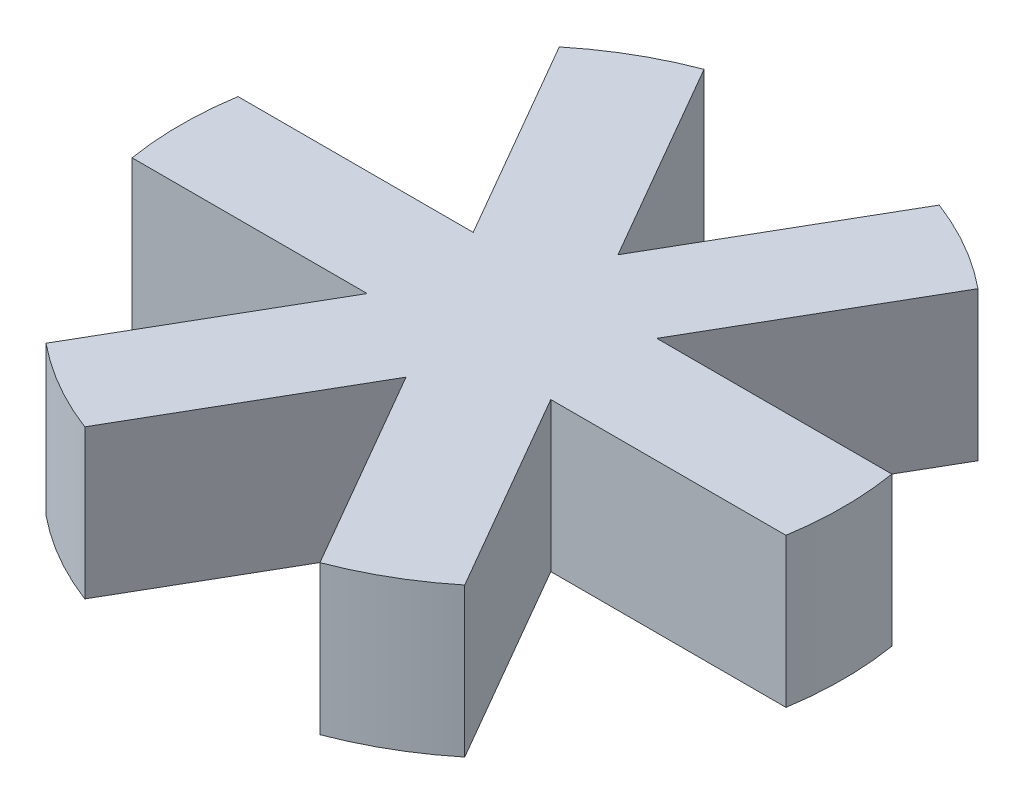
ISO-10303-21;
HEADER;
FILE_DESCRIPTION(('STEP AP214'),'2;1');
FILE_NAME('part.step','',(''),(''),'','','');
FILE_SCHEMA(('AUTOMOTIVE_DESIGN { 1 0 10303 214 1 1 1 1 }'));
ENDSEC;
DATA;
#1=APPLICATION_CONTEXT('core data for automotive mechanical design processes');
#2=APPLICATION_PROTOCOL_DEFINITION('international standard','automotive_design',2000,#1);
#3=PRODUCT_CONTEXT('',#1,'mechanical');
#4=PRODUCT('Part','Part','',(#3));
#5=PRODUCT_RELATED_PRODUCT_CATEGORY('part','',(#4));
#6=PRODUCT_DEFINITION_FORMATION('','',#4);
#7=PRODUCT_DEFINITION_CONTEXT('part definition',#1,'design');
#8=PRODUCT_DEFINITION('design','',#6,#7);
#9=PRODUCT_DEFINITION_SHAPE('','',#8);
#10=(LENGTH_UNIT() NAMED_UNIT(*) SI_UNIT(.MILLI.,.METRE.));
#11=(NAMED_UNIT(*) PLANE_ANGLE_UNIT() SI_UNIT($,.RADIAN.));
#12=(NAMED_UNIT(*) SI_UNIT($,.STERADIAN.) SOLID_ANGLE_UNIT());
#13=UNCERTAINTY_MEASURE_WITH_UNIT(LENGTH_MEASURE(1.E-05),#10,'distance_accuracy_value','');
#14=(GEOMETRIC_REPRESENTATION_CONTEXT(3) GLOBAL_UNCERTAINTY_ASSIGNED_CONTEXT((#13)) GLOBAL_UNIT_ASSIGNED_CONTEXT((#10,
#11,#12)) REPRESENTATION_CONTEXT('',''));
#15=CARTESIAN_POINT('',(0.,0.,0.));
#16=DIRECTION('',(0.,0.,1.));
#17=DIRECTION('',(1.,0.,0.));
#18=AXIS2_PLACEMENT_3D('',#15,#16,#17);
#19=CARTESIAN_POINT('',(0.,3.571875,0.));
#20=DIRECTION('',(0.,-1.,0.));
#21=DIRECTION('',(0.,0.,-1.));
#22=AXIS2_PLACEMENT_3D('',#19,#20,#21);
#23=CYLINDRICAL_SURFACE('',#22,7.9375);
#24=CARTESIAN_POINT('',(0.,0.,0.));
#25=DIRECTION('',(0.,1.,0.));
#26=DIRECTION('',(0.,0.,-1.));
#27=AXIS2_PLACEMENT_3D('',#24,#25,#26);
#28=CIRCLE('',#27,7.9375);
#29=CARTESIAN_POINT('',(7.83524130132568,0.,1.27000000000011));
#30=VERTEX_POINT('',#29);
#31=CARTESIAN_POINT('',(7.8352413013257,0.,-1.27));
#32=VERTEX_POINT('',#31);
#33=EDGE_CURVE('E188',#30,#32,#28,.T.);
#34=ORIENTED_EDGE('',*,*,#33,.T.);
#35=DIRECTION('',(0.,-1.,0.));
#36=VECTOR('',#35,1.);
#37=CARTESIAN_POINT('',(7.8352413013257,3.571875,-1.27));
#38=LINE('',#37,#36);
#39=CARTESIAN_POINT('',(7.8352413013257,3.571875,-1.27));
#40=VERTEX_POINT('',#39);
#41=EDGE_CURVE('E11',#40,#32,#38,.T.);
#42=ORIENTED_EDGE('',*,*,#41,.F.);
#43=CARTESIAN_POINT('',(0.,3.571875,0.));
#44=DIRECTION('',(0.,1.,0.));
#45=DIRECTION('',(0.,0.,-1.));
#46=AXIS2_PLACEMENT_3D('',#43,#44,#45);
#47=CIRCLE('',#46,7.9375);
#48=CARTESIAN_POINT('',(7.83524130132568,3.571875,1.27000000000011));
#49=VERTEX_POINT('',#48);
#50=EDGE_CURVE('E222',#49,#40,#47,.T.);
#51=ORIENTED_EDGE('',*,*,#50,.F.);
#52=DIRECTION('',(0.,-1.,0.));
#53=VECTOR('',#52,1.);
#54=CARTESIAN_POINT('',(7.83524130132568,3.571875,1.27000000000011));
#55=LINE('',#54,#53);
#56=EDGE_CURVE('E184',#49,#30,#55,.T.);
#57=ORIENTED_EDGE('',*,*,#56,.T.);
#58=EDGE_LOOP('',(#34,#42,#51,#57));
#59=FACE_BOUND('',#58,.T.);
#60=ADVANCED_FACE('F32',(#59),#23,.T.);
#61=CARTESIAN_POINT('',(2.1997045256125,3.571875,-1.27));
#62=DIRECTION('',(0.,0.,1.));
#63=DIRECTION('',(1.,0.,0.));
#64=AXIS2_PLACEMENT_3D('',#61,#62,#63);
#65=PLANE('',#64);
#66=DIRECTION('',(-1.,0.,0.));
#67=VECTOR('',#66,1.);
#68=CARTESIAN_POINT('',(2.1997045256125,0.,-1.27));
#69=LINE('',#68,#67);
#70=CARTESIAN_POINT('',(2.1997045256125,0.,-1.27));
#71=VERTEX_POINT('',#70);
#72=EDGE_CURVE('E191',#32,#71,#69,.T.);
#73=ORIENTED_EDGE('',*,*,#72,.T.);
#74=DIRECTION('',(0.,-1.,0.));
#75=VECTOR('',#74,1.);
#76=CARTESIAN_POINT('',(2.1997045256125,3.571875,-1.27));
#77=LINE('',#76,#75);
#78=CARTESIAN_POINT('',(2.1997045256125,3.571875,-1.27));
#79=VERTEX_POINT('',#78);
#80=EDGE_CURVE('E40',#79,#71,#77,.T.);
#81=ORIENTED_EDGE('',*,*,#80,.F.);
#82=DIRECTION('',(-1.,0.,0.));
#83=VECTOR('',#82,1.);
#84=CARTESIAN_POINT('',(2.1997045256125,3.571875,-1.27));
#85=LINE('',#84,#83);
#86=EDGE_CURVE('E121',#40,#79,#85,.T.);
#87=ORIENTED_EDGE('',*,*,#86,.F.);
#88=ORIENTED_EDGE('',*,*,#41,.T.);
#89=EDGE_LOOP('',(#73,#81,#87,#88));
#90=FACE_BOUND('',#89,.T.);
#91=ADVANCED_FACE('F330',(#90),#65,.F.);
#92=CARTESIAN_POINT('',(2.1997045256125,3.571875,-1.27));
#93=DIRECTION('',(-0.866025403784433,0.,-0.50000000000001));
#94=DIRECTION('',(-0.50000000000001,0.,0.866025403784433));
#95=AXIS2_PLACEMENT_3D('',#92,#93,#94);
#96=PLANE('',#95);
#97=DIRECTION('',(0.50000000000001,0.,-0.866025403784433));
#98=VECTOR('',#97,1.);
#99=CARTESIAN_POINT('',(2.1997045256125,0.,-1.27));
#100=LINE('',#99,#98);
#101=CARTESIAN_POINT('',(5.01747291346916,0.,-6.15051801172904));
#102=VERTEX_POINT('',#101);
#103=EDGE_CURVE('E193',#71,#102,#100,.T.);
#104=ORIENTED_EDGE('',*,*,#103,.T.);
#105=DIRECTION('',(0.,-1.,0.));
#106=VECTOR('',#105,1.);
#107=CARTESIAN_POINT('',(5.01747291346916,3.571875,-6.15051801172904));
#108=LINE('',#107,#106);
#109=CARTESIAN_POINT('',(5.01747291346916,3.571875,-6.15051801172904));
#110=VERTEX_POINT('',#109);
#111=EDGE_CURVE('E259',#110,#102,#108,.T.);
#112=ORIENTED_EDGE('',*,*,#111,.F.);
#113=DIRECTION('',(0.50000000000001,0.,-0.866025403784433));
#114=VECTOR('',#113,1.);
#115=CARTESIAN_POINT('',(2.1997045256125,3.571875,-1.27));
#116=LINE('',#115,#114);
#117=EDGE_CURVE('E267',#79,#110,#116,.T.);
#118=ORIENTED_EDGE('',*,*,#117,.F.);
#119=ORIENTED_EDGE('',*,*,#80,.T.);
#120=EDGE_LOOP('',(#104,#112,#118,#119));
#121=FACE_BOUND('',#120,.T.);
#122=ADVANCED_FACE('F265',(#121),#96,.F.);
#123=CARTESIAN_POINT('',(0.,3.571875,0.));
#124=DIRECTION('',(0.,-1.,0.));
#125=DIRECTION('',(0.,0.,-1.));
#126=AXIS2_PLACEMENT_3D('',#123,#124,#125);
#127=CYLINDRICAL_SURFACE('',#126,7.9375);
#128=CARTESIAN_POINT('',(0.,0.,0.));
#129=DIRECTION('',(0.,1.,0.));
#130=DIRECTION('',(0.,0.,-1.));
#131=AXIS2_PLACEMENT_3D('',#128,#129,#130);
#132=CIRCLE('',#131,7.9375);
#133=CARTESIAN_POINT('',(2.8177683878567,0.,-7.42051801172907));
#134=VERTEX_POINT('',#133);
#135=EDGE_CURVE('E195',#102,#134,#132,.T.);
#136=ORIENTED_EDGE('',*,*,#135,.T.);
#137=DIRECTION('',(0.,-1.,0.));
#138=VECTOR('',#137,1.);
#139=CARTESIAN_POINT('',(2.8177683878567,3.571875,-7.42051801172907));
#140=LINE('',#139,#138);
#141=CARTESIAN_POINT('',(2.8177683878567,3.571875,-7.42051801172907));
#142=VERTEX_POINT('',#141);
#143=EDGE_CURVE('E256',#142,#134,#140,.T.);
#144=ORIENTED_EDGE('',*,*,#143,.F.);
#145=CARTESIAN_POINT('',(0.,3.571875,0.));
#146=DIRECTION('',(0.,1.,0.));
#147=DIRECTION('',(0.,0.,-1.));
#148=AXIS2_PLACEMENT_3D('',#145,#146,#147);
#149=CIRCLE('',#148,7.9375);
#150=EDGE_CURVE('E285',#110,#142,#149,.T.);
#151=ORIENTED_EDGE('',*,*,#150,.F.);
#152=ORIENTED_EDGE('',*,*,#111,.T.);
#153=EDGE_LOOP('',(#136,#144,#151,#152));
#154=FACE_BOUND('',#153,.T.);
#155=ADVANCED_FACE('F276',(#154),#127,.T.);
#156=CARTESIAN_POINT('',(0.,3.571875,-2.54000000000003));
#157=DIRECTION('',(0.866025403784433,0.,0.50000000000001));
#158=DIRECTION('',(0.50000000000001,0.,-0.866025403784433));
#159=AXIS2_PLACEMENT_3D('',#156,#157,#158);
#160=PLANE('',#159);
#161=DIRECTION('',(-0.50000000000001,0.,0.866025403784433));
#162=VECTOR('',#161,1.);
#163=CARTESIAN_POINT('',(0.,0.,-2.54000000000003));
#164=LINE('',#163,#162);
#165=CARTESIAN_POINT('',(0.,0.,-2.54000000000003));
#166=VERTEX_POINT('',#165);
#167=EDGE_CURVE('E197',#134,#166,#164,.T.);
#168=ORIENTED_EDGE('',*,*,#167,.T.);
#169=DIRECTION('',(0.,-1.,0.));
#170=VECTOR('',#169,1.);
#171=CARTESIAN_POINT('',(0.,3.571875,-2.54000000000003));
#172=LINE('',#171,#170);
#173=CARTESIAN_POINT('',(0.,3.571875,-2.54000000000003));
#174=VERTEX_POINT('',#173);
#175=EDGE_CURVE('E253',#174,#166,#172,.T.);
#176=ORIENTED_EDGE('',*,*,#175,.F.);
#177=DIRECTION('',(-0.50000000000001,0.,0.866025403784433));
#178=VECTOR('',#177,1.);
#179=CARTESIAN_POINT('',(0.,3.571875,-2.54000000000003));
#180=LINE('',#179,#178);
#181=EDGE_CURVE('E282',#142,#174,#180,.T.);
#182=ORIENTED_EDGE('',*,*,#181,.F.);
#183=ORIENTED_EDGE('',*,*,#143,.T.);
#184=EDGE_LOOP('',(#168,#176,#182,#183));
#185=FACE_BOUND('',#184,.T.);
#186=ADVANCED_FACE('F280',(#185),#160,.F.);
#187=CARTESIAN_POINT('',(0.,3.571875,-2.54000000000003));
#188=DIRECTION('',(-0.866025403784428,0.,0.500000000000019));
#189=DIRECTION('',(0.500000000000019,0.,0.866025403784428));
#190=AXIS2_PLACEMENT_3D('',#187,#188,#189);
#191=PLANE('',#190);
#192=DIRECTION('',(-0.500000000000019,0.,-0.866025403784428));
#193=VECTOR('',#192,1.);
#194=CARTESIAN_POINT('',(0.,0.,-2.54000000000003));
#195=LINE('',#194,#193);
#196=CARTESIAN_POINT('',(-2.81776838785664,0.,-7.42051801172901));
#197=VERTEX_POINT('',#196);
#198=EDGE_CURVE('E199',#166,#197,#195,.T.);
#199=ORIENTED_EDGE('',*,*,#198,.T.);
#200=DIRECTION('',(0.,-1.,0.));
#201=VECTOR('',#200,1.);
#202=CARTESIAN_POINT('',(-2.81776838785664,3.571875,-7.42051801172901));
#203=LINE('',#202,#201);
#204=CARTESIAN_POINT('',(-2.81776838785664,3.571875,-7.42051801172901));
#205=VERTEX_POINT('',#204);
#206=EDGE_CURVE('E250',#205,#197,#203,.T.);
#207=ORIENTED_EDGE('',*,*,#206,.F.);
#208=DIRECTION('',(-0.500000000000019,0.,-0.866025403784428));
#209=VECTOR('',#208,1.);
#210=CARTESIAN_POINT('',(0.,3.571875,-2.54000000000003));
#211=LINE('',#210,#209);
#212=EDGE_CURVE('E284',#174,#205,#211,.T.);
#213=ORIENTED_EDGE('',*,*,#212,.F.);
#214=ORIENTED_EDGE('',*,*,#175,.T.);
#215=EDGE_LOOP('',(#199,#207,#213,#214));
#216=FACE_BOUND('',#215,.T.);
#217=ADVANCED_FACE('F343',(#216),#191,.F.);
#218=CARTESIAN_POINT('',(0.,3.571875,0.));
#219=DIRECTION('',(0.,-1.,0.));
#220=DIRECTION('',(0.,0.,-1.));
#221=AXIS2_PLACEMENT_3D('',#218,#219,#220);
#222=CYLINDRICAL_SURFACE('',#221,7.93749999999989);
#223=CARTESIAN_POINT('',(0.,0.,0.));
#224=DIRECTION('',(0.,1.,0.));
#225=DIRECTION('',(0.,0.,-1.));
#226=AXIS2_PLACEMENT_3D('',#223,#224,#225);
#227=CIRCLE('',#226,7.93749999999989);
#228=CARTESIAN_POINT('',(-5.01747291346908,0.,-6.15051801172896));
#229=VERTEX_POINT('',#228);
#230=EDGE_CURVE('E201',#197,#229,#227,.T.);
#231=ORIENTED_EDGE('',*,*,#230,.T.);
#232=DIRECTION('',(0.,-1.,0.));
#233=VECTOR('',#232,1.);
#234=CARTESIAN_POINT('',(-5.01747291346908,3.571875,-6.15051801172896));
#235=LINE('',#234,#233);
#236=CARTESIAN_POINT('',(-5.01747291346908,3.571875,-6.15051801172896));
#237=VERTEX_POINT('',#236);
#238=EDGE_CURVE('E247',#237,#229,#235,.T.);
#239=ORIENTED_EDGE('',*,*,#238,.F.);
#240=CARTESIAN_POINT('',(0.,3.571875,0.));
#241=DIRECTION('',(0.,1.,0.));
#242=DIRECTION('',(0.,0.,-1.));
#243=AXIS2_PLACEMENT_3D('',#240,#241,#242);
#244=CIRCLE('',#243,7.93749999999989);
#245=EDGE_CURVE('E287',#205,#237,#244,.T.);
#246=ORIENTED_EDGE('',*,*,#245,.F.);
#247=ORIENTED_EDGE('',*,*,#206,.T.);
#248=EDGE_LOOP('',(#231,#239,#246,#247));
#249=FACE_BOUND('',#248,.T.);
#250=ADVANCED_FACE('F346',(#249),#222,.T.);
#251=CARTESIAN_POINT('',(-2.19970452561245,3.571875,-1.26999999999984));
#252=DIRECTION('',(0.866025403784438,0.,-0.500000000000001));
#253=DIRECTION('',(-0.500000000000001,0.,-0.866025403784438));
#254=AXIS2_PLACEMENT_3D('',#251,#252,#253);
#255=PLANE('',#254);
#256=DIRECTION('',(0.500000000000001,0.,0.866025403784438));
#257=VECTOR('',#256,1.);
#258=CARTESIAN_POINT('',(-2.19970452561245,0.,-1.26999999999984));
#259=LINE('',#258,#257);
#260=CARTESIAN_POINT('',(-2.19970452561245,0.,-1.26999999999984));
#261=VERTEX_POINT('',#260);
#262=EDGE_CURVE('E203',#229,#261,#259,.T.);
#263=ORIENTED_EDGE('',*,*,#262,.T.);
#264=DIRECTION('',(0.,-1.,0.));
#265=VECTOR('',#264,1.);
#266=CARTESIAN_POINT('',(-2.19970452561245,3.571875,-1.26999999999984));
#267=LINE('',#266,#265);
#268=CARTESIAN_POINT('',(-2.19970452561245,3.571875,-1.26999999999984));
#269=VERTEX_POINT('',#268);
#270=EDGE_CURVE('E244',#269,#261,#267,.T.);
#271=ORIENTED_EDGE('',*,*,#270,.F.);
#272=DIRECTION('',(0.500000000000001,0.,0.866025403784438));
#273=VECTOR('',#272,1.);
#274=CARTESIAN_POINT('',(-2.19970452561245,3.571875,-1.26999999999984));
#275=LINE('',#274,#273);
#276=EDGE_CURVE('E293',#237,#269,#275,.T.);
#277=ORIENTED_EDGE('',*,*,#276,.F.);
#278=ORIENTED_EDGE('',*,*,#238,.T.);
#279=EDGE_LOOP('',(#263,#271,#277,#278));
#280=FACE_BOUND('',#279,.T.);
#281=ADVANCED_FACE('F350',(#280),#255,.F.);
#282=CARTESIAN_POINT('',(-2.19970452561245,3.571875,-1.26999999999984));
#283=DIRECTION('',(0.,0.,1.));
#284=DIRECTION('',(1.,0.,0.));
#285=AXIS2_PLACEMENT_3D('',#282,#283,#284);
#286=PLANE('',#285);
#287=DIRECTION('',(-1.,0.,0.));
#288=VECTOR('',#287,1.);
#289=CARTESIAN_POINT('',(-2.19970452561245,0.,-1.26999999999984));
#290=LINE('',#289,#288);
#291=CARTESIAN_POINT('',(-7.83524130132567,0.,-1.26999999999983));
#292=VERTEX_POINT('',#291);
#293=EDGE_CURVE('E205',#261,#292,#290,.T.);
#294=ORIENTED_EDGE('',*,*,#293,.T.);
#295=DIRECTION('',(0.,-1.,0.));
#296=VECTOR('',#295,1.);
#297=CARTESIAN_POINT('',(-7.83524130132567,3.571875,-1.26999999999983));
#298=LINE('',#297,#296);
#299=CARTESIAN_POINT('',(-7.83524130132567,3.571875,-1.26999999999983));
#300=VERTEX_POINT('',#299);
#301=EDGE_CURVE('E241',#300,#292,#298,.T.);
#302=ORIENTED_EDGE('',*,*,#301,.F.);
#303=DIRECTION('',(-1.,0.,0.));
#304=VECTOR('',#303,1.);
#305=CARTESIAN_POINT('',(-2.19970452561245,3.571875,-1.26999999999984));
#306=LINE('',#305,#304);
#307=EDGE_CURVE('E295',#269,#300,#306,.T.);
#308=ORIENTED_EDGE('',*,*,#307,.F.);
#309=ORIENTED_EDGE('',*,*,#270,.T.);
#310=EDGE_LOOP('',(#294,#302,#308,#309));
#311=FACE_BOUND('',#310,.T.);
#312=ADVANCED_FACE('F354',(#311),#286,.F.);
#313=CARTESIAN_POINT('',(1.18828558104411E-13,3.571875,1.43114686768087E-13));
#314=DIRECTION('',(0.,-1.,0.));
#315=DIRECTION('',(0.,0.,-1.));
#316=AXIS2_PLACEMENT_3D('',#313,#314,#315);
#317=CYLINDRICAL_SURFACE('',#316,7.93750000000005);
#318=CARTESIAN_POINT('',(1.18828558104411E-13,0.,1.43114686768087E-13));
#319=DIRECTION('',(0.,1.,0.));
#320=DIRECTION('',(0.,0.,-1.));
#321=AXIS2_PLACEMENT_3D('',#318,#319,#320);
#322=CIRCLE('',#321,7.93750000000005);
#323=CARTESIAN_POINT('',(-7.83524130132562,0.,1.27000000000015));
#324=VERTEX_POINT('',#323);
#325=EDGE_CURVE('E207',#292,#324,#322,.T.);
#326=ORIENTED_EDGE('',*,*,#325,.T.);
#327=DIRECTION('',(0.,-1.,0.));
#328=VECTOR('',#327,1.);
#329=CARTESIAN_POINT('',(-7.83524130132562,3.571875,1.27000000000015));
#330=LINE('',#329,#328);
#331=CARTESIAN_POINT('',(-7.83524130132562,3.571875,1.27000000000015));
#332=VERTEX_POINT('',#331);
#333=EDGE_CURVE('E238',#332,#324,#330,.T.);
#334=ORIENTED_EDGE('',*,*,#333,.F.);
#335=CARTESIAN_POINT('',(1.18828558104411E-13,3.571875,1.43114686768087E-13));
#336=DIRECTION('',(0.,1.,0.));
#337=DIRECTION('',(0.,0.,-1.));
#338=AXIS2_PLACEMENT_3D('',#335,#336,#337);
#339=CIRCLE('',#338,7.93750000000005);
#340=EDGE_CURVE('E297',#300,#332,#339,.T.);
#341=ORIENTED_EDGE('',*,*,#340,.F.);
#342=ORIENTED_EDGE('',*,*,#301,.T.);
#343=EDGE_LOOP('',(#326,#334,#341,#342));
#344=FACE_BOUND('',#343,.T.);
#345=ADVANCED_FACE('F358',(#344),#317,.T.);
#346=CARTESIAN_POINT('',(-2.19970452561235,3.571875,1.27000000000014));
#347=DIRECTION('',(0.,0.,-1.));
#348=DIRECTION('',(-1.,0.,0.));
#349=AXIS2_PLACEMENT_3D('',#346,#347,#348);
#350=PLANE('',#349);
#351=DIRECTION('',(1.,0.,0.));
#352=VECTOR('',#351,1.);
#353=CARTESIAN_POINT('',(-2.19970452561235,0.,1.27000000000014));
#354=LINE('',#353,#352);
#355=CARTESIAN_POINT('',(-2.19970452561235,0.,1.27000000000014));
#356=VERTEX_POINT('',#355);
#357=EDGE_CURVE('E209',#324,#356,#354,.T.);
#358=ORIENTED_EDGE('',*,*,#357,.T.);
#359=DIRECTION('',(0.,-1.,0.));
#360=VECTOR('',#359,1.);
#361=CARTESIAN_POINT('',(-2.19970452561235,3.571875,1.27000000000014));
#362=LINE('',#361,#360);
#363=CARTESIAN_POINT('',(-2.19970452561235,3.571875,1.27000000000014));
#364=VERTEX_POINT('',#363);
#365=EDGE_CURVE('E235',#364,#356,#362,.T.);
#366=ORIENTED_EDGE('',*,*,#365,.F.);
#367=DIRECTION('',(1.,0.,0.));
#368=VECTOR('',#367,1.);
#369=CARTESIAN_POINT('',(-2.19970452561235,3.571875,1.27000000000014));
#370=LINE('',#369,#368);
#371=EDGE_CURVE('E299',#332,#364,#370,.T.);
#372=ORIENTED_EDGE('',*,*,#371,.F.);
#373=ORIENTED_EDGE('',*,*,#333,.T.);
#374=EDGE_LOOP('',(#358,#366,#372,#373));
#375=FACE_BOUND('',#374,.T.);
#376=ADVANCED_FACE('F362',(#375),#350,.F.);
#377=CARTESIAN_POINT('',(-2.19970452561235,3.571875,1.27000000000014));
#378=DIRECTION('',(0.866025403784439,0.,0.499999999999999));
#379=DIRECTION('',(0.499999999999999,0.,-0.866025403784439));
#380=AXIS2_PLACEMENT_3D('',#377,#378,#379);
#381=PLANE('',#380);
#382=DIRECTION('',(-0.499999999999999,0.,0.866025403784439));
#383=VECTOR('',#382,1.);
#384=CARTESIAN_POINT('',(-2.19970452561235,0.,1.27000000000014));
#385=LINE('',#384,#383);
#386=CARTESIAN_POINT('',(-5.01747291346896,0.,6.15051801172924));
#387=VERTEX_POINT('',#386);
#388=EDGE_CURVE('E211',#356,#387,#385,.T.);
#389=ORIENTED_EDGE('',*,*,#388,.T.);
#390=DIRECTION('',(0.,-1.,0.));
#391=VECTOR('',#390,1.);
#392=CARTESIAN_POINT('',(-5.01747291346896,3.571875,6.15051801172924));
#393=LINE('',#392,#391);
#394=CARTESIAN_POINT('',(-5.01747291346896,3.571875,6.15051801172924));
#395=VERTEX_POINT('',#394);
#396=EDGE_CURVE('E232',#395,#387,#393,.T.);
#397=ORIENTED_EDGE('',*,*,#396,.F.);
#398=DIRECTION('',(-0.499999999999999,0.,0.866025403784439));
#399=VECTOR('',#398,1.);
#400=CARTESIAN_POINT('',(-2.19970452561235,3.571875,1.27000000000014));
#401=LINE('',#400,#399);
#402=EDGE_CURVE('E301',#364,#395,#401,.T.);
#403=ORIENTED_EDGE('',*,*,#402,.F.);
#404=ORIENTED_EDGE('',*,*,#365,.T.);
#405=EDGE_LOOP('',(#389,#397,#403,#404));
#406=FACE_BOUND('',#405,.T.);
#407=ADVANCED_FACE('F366',(#406),#381,.F.);
#408=CARTESIAN_POINT('',(1.196959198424E-13,3.571875,1.42247325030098E-13));
#409=DIRECTION('',(0.,-1.,0.));
#410=DIRECTION('',(0.,0.,-1.));
#411=AXIS2_PLACEMENT_3D('',#408,#409,#410);
#412=CYLINDRICAL_SURFACE('',#411,7.93749999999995);
#413=CARTESIAN_POINT('',(1.196959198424E-13,0.,1.42247325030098E-13));
#414=DIRECTION('',(0.,1.,0.));
#415=DIRECTION('',(0.,0.,-1.));
#416=AXIS2_PLACEMENT_3D('',#413,#414,#415);
#417=CIRCLE('',#416,7.93749999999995);
#418=CARTESIAN_POINT('',(-2.81776838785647,0.,7.4205180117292));
#419=VERTEX_POINT('',#418);
#420=EDGE_CURVE('E213',#387,#419,#417,.T.);
#421=ORIENTED_EDGE('',*,*,#420,.T.);
#422=DIRECTION('',(0.,-1.,0.));
#423=VECTOR('',#422,1.);
#424=CARTESIAN_POINT('',(-2.81776838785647,3.571875,7.4205180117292));
#425=LINE('',#424,#423);
#426=CARTESIAN_POINT('',(-2.81776838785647,3.571875,7.4205180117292));
#427=VERTEX_POINT('',#426);
#428=EDGE_CURVE('E229',#427,#419,#425,.T.);
#429=ORIENTED_EDGE('',*,*,#428,.F.);
#430=CARTESIAN_POINT('',(1.196959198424E-13,3.571875,1.42247325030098E-13));
#431=DIRECTION('',(0.,1.,0.));
#432=DIRECTION('',(0.,0.,-1.));
#433=AXIS2_PLACEMENT_3D('',#430,#431,#432);
#434=CIRCLE('',#433,7.93749999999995);
#435=EDGE_CURVE('E303',#395,#427,#434,.T.);
#436=ORIENTED_EDGE('',*,*,#435,.F.);
#437=ORIENTED_EDGE('',*,*,#396,.T.);
#438=EDGE_LOOP('',(#421,#429,#436,#437));
#439=FACE_BOUND('',#438,.T.);
#440=ADVANCED_FACE('F370',(#439),#412,.T.);
#441=CARTESIAN_POINT('',(1.52001641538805E-13,3.571875,2.54000000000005));
#442=DIRECTION('',(-0.866025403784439,0.,-0.5));
#443=DIRECTION('',(-0.5,0.,0.866025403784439));
#444=AXIS2_PLACEMENT_3D('',#441,#442,#443);
#445=PLANE('',#444);
#446=DIRECTION('',(0.5,0.,-0.866025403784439));
#447=VECTOR('',#446,1.);
#448=CARTESIAN_POINT('',(1.52001641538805E-13,0.,2.54000000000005));
#449=LINE('',#448,#447);
#450=CARTESIAN_POINT('',(1.52001641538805E-13,0.,2.54000000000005));
#451=VERTEX_POINT('',#450);
#452=EDGE_CURVE('E215',#419,#451,#449,.T.);
#453=ORIENTED_EDGE('',*,*,#452,.T.);
#454=DIRECTION('',(0.,-1.,0.));
#455=VECTOR('',#454,1.);
#456=CARTESIAN_POINT('',(1.52001641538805E-13,3.571875,2.54000000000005));
#457=LINE('',#456,#455);
#458=CARTESIAN_POINT('',(1.52001641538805E-13,3.571875,2.54000000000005));
#459=VERTEX_POINT('',#458);
#460=EDGE_CURVE('E226',#459,#451,#457,.T.);
#461=ORIENTED_EDGE('',*,*,#460,.F.);
#462=DIRECTION('',(0.5,0.,-0.866025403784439));
#463=VECTOR('',#462,1.);
#464=CARTESIAN_POINT('',(1.52001641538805E-13,3.571875,2.54000000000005));
#465=LINE('',#464,#463);
#466=EDGE_CURVE('E305',#427,#459,#465,.T.);
#467=ORIENTED_EDGE('',*,*,#466,.F.);
#468=ORIENTED_EDGE('',*,*,#428,.T.);
#469=EDGE_LOOP('',(#453,#461,#467,#468));
#470=FACE_BOUND('',#469,.T.);
#471=ADVANCED_FACE('F311',(#470),#445,.F.);
#472=CARTESIAN_POINT('',(1.52001641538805E-13,3.571875,2.54000000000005));
#473=DIRECTION('',(0.866025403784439,0.,-0.5));
#474=DIRECTION('',(-0.5,0.,-0.866025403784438));
#475=AXIS2_PLACEMENT_3D('',#472,#473,#474);
#476=PLANE('',#475);
#477=DIRECTION('',(0.5,0.,0.866025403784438));
#478=VECTOR('',#477,1.);
#479=CARTESIAN_POINT('',(1.52001641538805E-13,0.,2.54000000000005));
#480=LINE('',#479,#478);
#481=CARTESIAN_POINT('',(2.81776838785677,0.,7.42051801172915));
#482=VERTEX_POINT('',#481);
#483=EDGE_CURVE('E217',#451,#482,#480,.T.);
#484=ORIENTED_EDGE('',*,*,#483,.T.);
#485=DIRECTION('',(0.,-1.,0.));
#486=VECTOR('',#485,1.);
#487=CARTESIAN_POINT('',(2.81776838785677,3.571875,7.42051801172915));
#488=LINE('',#487,#486);
#489=CARTESIAN_POINT('',(2.81776838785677,3.571875,7.42051801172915));
#490=VERTEX_POINT('',#489);
#491=EDGE_CURVE('E179',#490,#482,#488,.T.);
#492=ORIENTED_EDGE('',*,*,#491,.F.);
#493=DIRECTION('',(0.5,0.,0.866025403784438));
#494=VECTOR('',#493,1.);
#495=CARTESIAN_POINT('',(1.52001641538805E-13,3.571875,2.54000000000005));
#496=LINE('',#495,#494);
#497=EDGE_CURVE('E170',#459,#490,#496,.T.);
#498=ORIENTED_EDGE('',*,*,#497,.F.);
#499=ORIENTED_EDGE('',*,*,#460,.T.);
#500=EDGE_LOOP('',(#484,#492,#498,#499));
#501=FACE_BOUND('',#500,.T.);
#502=ADVANCED_FACE('F315',(#501),#476,.F.);
#503=CARTESIAN_POINT('',(0.,3.571875,0.));
#504=DIRECTION('',(0.,-1.,0.));
#505=DIRECTION('',(0.,0.,-1.));
#506=AXIS2_PLACEMENT_3D('',#503,#504,#505);
#507=CYLINDRICAL_SURFACE('',#506,7.93750000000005);
#508=CARTESIAN_POINT('',(0.,0.,0.));
#509=DIRECTION('',(0.,1.,0.));
#510=DIRECTION('',(0.,0.,-1.));
#511=AXIS2_PLACEMENT_3D('',#508,#509,#510);
#512=CIRCLE('',#511,7.93750000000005);
#513=CARTESIAN_POINT('',(5.01747291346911,0.,6.15051801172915));
#514=VERTEX_POINT('',#513);
#515=EDGE_CURVE('E178',#482,#514,#512,.T.);
#516=ORIENTED_EDGE('',*,*,#515,.T.);
#517=DIRECTION('',(0.,-1.,0.));
#518=VECTOR('',#517,1.);
#519=CARTESIAN_POINT('',(5.01747291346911,3.571875,6.15051801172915));
#520=LINE('',#519,#518);
#521=CARTESIAN_POINT('',(5.01747291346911,3.571875,6.15051801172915));
#522=VERTEX_POINT('',#521);
#523=EDGE_CURVE('E175',#522,#514,#520,.T.);
#524=ORIENTED_EDGE('',*,*,#523,.F.);
#525=CARTESIAN_POINT('',(0.,3.571875,0.));
#526=DIRECTION('',(0.,1.,0.));
#527=DIRECTION('',(0.,0.,-1.));
#528=AXIS2_PLACEMENT_3D('',#525,#526,#527);
#529=CIRCLE('',#528,7.93750000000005);
#530=EDGE_CURVE('E164',#490,#522,#529,.T.);
#531=ORIENTED_EDGE('',*,*,#530,.F.);
#532=ORIENTED_EDGE('',*,*,#491,.T.);
#533=EDGE_LOOP('',(#516,#524,#531,#532));
#534=FACE_BOUND('',#533,.T.);
#535=ADVANCED_FACE('F176',(#534),#507,.T.);
#536=CARTESIAN_POINT('',(2.19970452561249,3.571875,1.27000000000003));
#537=DIRECTION('',(-0.86602540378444,0.,0.499999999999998));
#538=DIRECTION('',(0.499999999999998,0.,0.86602540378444));
#539=AXIS2_PLACEMENT_3D('',#536,#537,#538);
#540=PLANE('',#539);
#541=DIRECTION('',(-0.499999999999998,0.,-0.86602540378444));
#542=VECTOR('',#541,1.);
#543=CARTESIAN_POINT('',(2.19970452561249,0.,1.27000000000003));
#544=LINE('',#543,#542);
#545=CARTESIAN_POINT('',(2.19970452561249,0.,1.27000000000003));
#546=VERTEX_POINT('',#545);
#547=EDGE_CURVE('E107',#514,#546,#544,.T.);
#548=ORIENTED_EDGE('',*,*,#547,.T.);
#549=DIRECTION('',(0.,-1.,0.));
#550=VECTOR('',#549,1.);
#551=CARTESIAN_POINT('',(2.19970452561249,3.571875,1.27000000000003));
#552=LINE('',#551,#550);
#553=CARTESIAN_POINT('',(2.19970452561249,3.571875,1.27000000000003));
#554=VERTEX_POINT('',#553);
#555=EDGE_CURVE('E180',#554,#546,#552,.T.);
#556=ORIENTED_EDGE('',*,*,#555,.F.);
#557=DIRECTION('',(-0.499999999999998,0.,-0.86602540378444));
#558=VECTOR('',#557,1.);
#559=CARTESIAN_POINT('',(2.19970452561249,3.571875,1.27000000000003));
#560=LINE('',#559,#558);
#561=EDGE_CURVE('E168',#522,#554,#560,.T.);
#562=ORIENTED_EDGE('',*,*,#561,.F.);
#563=ORIENTED_EDGE('',*,*,#523,.T.);
#564=EDGE_LOOP('',(#548,#556,#562,#563));
#565=FACE_BOUND('',#564,.T.);
#566=ADVANCED_FACE('F182',(#565),#540,.F.);
#567=CARTESIAN_POINT('',(2.19970452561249,3.571875,1.27000000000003));
#568=DIRECTION('',(0.,0.,-1.));
#569=DIRECTION('',(-1.,0.,0.));
#570=AXIS2_PLACEMENT_3D('',#567,#568,#569);
#571=PLANE('',#570);
#572=DIRECTION('',(1.,0.,0.));
#573=VECTOR('',#572,1.);
#574=CARTESIAN_POINT('',(2.19970452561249,0.,1.27000000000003));
#575=LINE('',#574,#573);
#576=EDGE_CURVE('E113',#546,#30,#575,.T.);
#577=ORIENTED_EDGE('',*,*,#576,.T.);
#578=ORIENTED_EDGE('',*,*,#56,.F.);
#579=DIRECTION('',(1.,0.,0.));
#580=VECTOR('',#579,1.);
#581=CARTESIAN_POINT('',(2.19970452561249,3.571875,1.27000000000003));
#582=LINE('',#581,#580);
#583=EDGE_CURVE('E48',#554,#49,#582,.T.);
#584=ORIENTED_EDGE('',*,*,#583,.F.);
#585=ORIENTED_EDGE('',*,*,#555,.T.);
#586=EDGE_LOOP('',(#577,#578,#584,#585));
#587=FACE_BOUND('',#586,.T.);
#588=ADVANCED_FACE('F319',(#587),#571,.F.);
#589=CARTESIAN_POINT('',(0.,3.571875,0.));
#590=DIRECTION('',(0.,-1.,0.));
#591=DIRECTION('',(0.,0.,-1.));
#592=AXIS2_PLACEMENT_3D('',#589,#590,#591);
#593=PLANE('',#592);
#594=ORIENTED_EDGE('',*,*,#50,.T.);
#595=ORIENTED_EDGE('',*,*,#86,.T.);
#596=ORIENTED_EDGE('',*,*,#117,.T.);
#597=ORIENTED_EDGE('',*,*,#150,.T.);
#598=ORIENTED_EDGE('',*,*,#181,.T.);
#599=ORIENTED_EDGE('',*,*,#212,.T.);
#600=ORIENTED_EDGE('',*,*,#245,.T.);
#601=ORIENTED_EDGE('',*,*,#276,.T.);
#602=ORIENTED_EDGE('',*,*,#307,.T.);
#603=ORIENTED_EDGE('',*,*,#340,.T.);
#604=ORIENTED_EDGE('',*,*,#371,.T.);
#605=ORIENTED_EDGE('',*,*,#402,.T.);
#606=ORIENTED_EDGE('',*,*,#435,.T.);
#607=ORIENTED_EDGE('',*,*,#466,.T.);
#608=ORIENTED_EDGE('',*,*,#497,.T.);
#609=ORIENTED_EDGE('',*,*,#530,.T.);
#610=ORIENTED_EDGE('',*,*,#561,.T.);
#611=ORIENTED_EDGE('',*,*,#583,.T.);
#612=EDGE_LOOP('',(#594,#595,#596,#597,#598,#599,#600,#601,#602,#603,#604,#605,#606,#607,#608,
#609,#610,#611));
#613=FACE_BOUND('',#612,.T.);
#614=ADVANCED_FACE('F166',(#613),#593,.F.);
#615=CARTESIAN_POINT('',(0.,0.,0.));
#616=DIRECTION('',(0.,-1.,0.));
#617=DIRECTION('',(0.,0.,-1.));
#618=AXIS2_PLACEMENT_3D('',#615,#616,#617);
#619=PLANE('',#618);
#620=ORIENTED_EDGE('',*,*,#33,.F.);
#621=ORIENTED_EDGE('',*,*,#576,.F.);
#622=ORIENTED_EDGE('',*,*,#547,.F.);
#623=ORIENTED_EDGE('',*,*,#515,.F.);
#624=ORIENTED_EDGE('',*,*,#483,.F.);
#625=ORIENTED_EDGE('',*,*,#452,.F.);
#626=ORIENTED_EDGE('',*,*,#420,.F.);
#627=ORIENTED_EDGE('',*,*,#388,.F.);
#628=ORIENTED_EDGE('',*,*,#357,.F.);
#629=ORIENTED_EDGE('',*,*,#325,.F.);
#630=ORIENTED_EDGE('',*,*,#293,.F.);
#631=ORIENTED_EDGE('',*,*,#262,.F.);
#632=ORIENTED_EDGE('',*,*,#230,.F.);
#633=ORIENTED_EDGE('',*,*,#198,.F.);
#634=ORIENTED_EDGE('',*,*,#167,.F.);
#635=ORIENTED_EDGE('',*,*,#135,.F.);
#636=ORIENTED_EDGE('',*,*,#103,.F.);
#637=ORIENTED_EDGE('',*,*,#72,.F.);
#638=EDGE_LOOP('',(#620,#621,#622,#623,#624,#625,#626,#627,#628,#629,#630,#631,#632,#633,#634,
#635,#636,#637));
#639=FACE_BOUND('',#638,.T.);
#640=ADVANCED_FACE('F271',(#639),#619,.T.);
#641=CLOSED_SHELL('',(#60,#91,#122,#155,#186,#217,#250,#281,#312,#345,#376,#407,#440,#471,#502,
#535,#566,#588,#614,#640));
#642=MANIFOLD_SOLID_BREP('B2',#641);
#643=ADVANCED_BREP_SHAPE_REPRESENTATION('',(#18,#642),#14);
#644=SHAPE_DEFINITION_REPRESENTATION(#9,#643);
ENDSEC;
END-ISO-10303-21;
